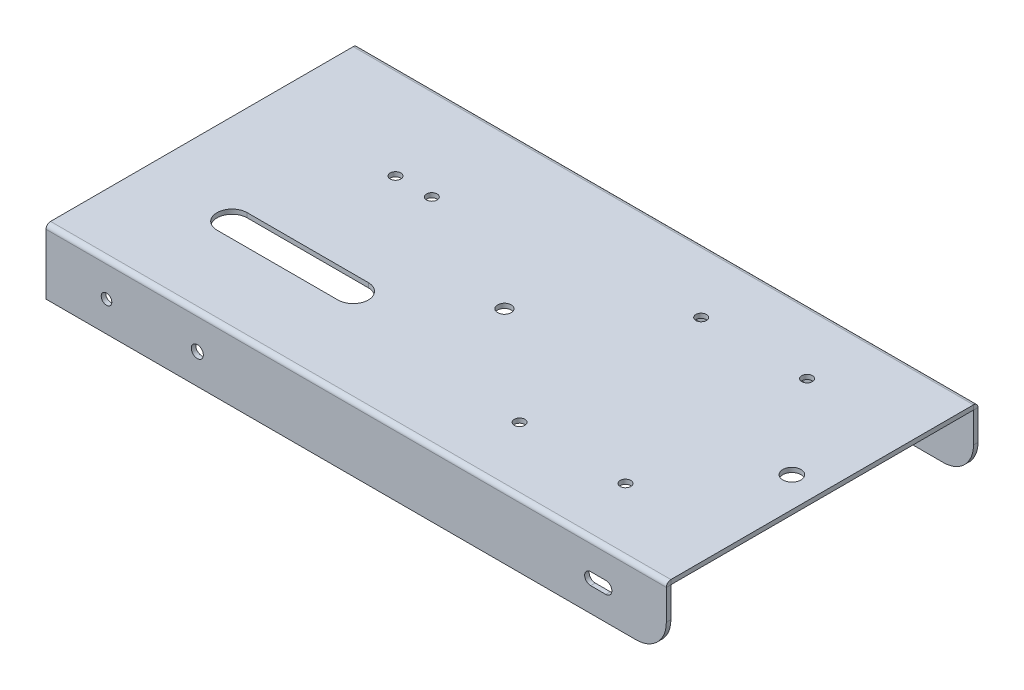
ISO-10303-21;
HEADER;
FILE_DESCRIPTION(('STEP AP214'),'2;1');
FILE_NAME('part.step','',(''),(''),'','','');
FILE_SCHEMA(('AUTOMOTIVE_DESIGN { 1 0 10303 214 1 1 1 1 }'));
ENDSEC;
DATA;
#1=APPLICATION_CONTEXT('core data for automotive mechanical design processes');
#2=APPLICATION_PROTOCOL_DEFINITION('international standard','automotive_design',2000,#1);
#3=PRODUCT_CONTEXT('',#1,'mechanical');
#4=PRODUCT('Part','Part','',(#3));
#5=PRODUCT_RELATED_PRODUCT_CATEGORY('part','',(#4));
#6=PRODUCT_DEFINITION_FORMATION('','',#4);
#7=PRODUCT_DEFINITION_CONTEXT('part definition',#1,'design');
#8=PRODUCT_DEFINITION('design','',#6,#7);
#9=PRODUCT_DEFINITION_SHAPE('','',#8);
#10=(LENGTH_UNIT() NAMED_UNIT(*) SI_UNIT(.MILLI.,.METRE.));
#11=(NAMED_UNIT(*) PLANE_ANGLE_UNIT() SI_UNIT($,.RADIAN.));
#12=(NAMED_UNIT(*) SI_UNIT($,.STERADIAN.) SOLID_ANGLE_UNIT());
#13=UNCERTAINTY_MEASURE_WITH_UNIT(LENGTH_MEASURE(1.E-05),#10,'distance_accuracy_value','');
#14=(GEOMETRIC_REPRESENTATION_CONTEXT(3) GLOBAL_UNCERTAINTY_ASSIGNED_CONTEXT((#13)) GLOBAL_UNIT_ASSIGNED_CONTEXT((#10,
#11,#12)) REPRESENTATION_CONTEXT('',''));
#15=CARTESIAN_POINT('',(0.,0.,0.));
#16=DIRECTION('',(0.,0.,1.));
#17=DIRECTION('',(1.,0.,0.));
#18=AXIS2_PLACEMENT_3D('',#15,#16,#17);
#19=CARTESIAN_POINT('',(205.,1.5,-60.));
#20=DIRECTION('',(-1.,0.,0.));
#21=DIRECTION('',(0.,0.,1.));
#22=AXIS2_PLACEMENT_3D('',#19,#20,#21);
#23=PLANE('',#22);
#24=DIRECTION('',(0.,0.,-1.));
#25=VECTOR('',#24,1.);
#26=CARTESIAN_POINT('',(205.,1.5,-60.));
#27=LINE('',#26,#25);
#28=CARTESIAN_POINT('',(205.,1.5,49.9999882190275));
#29=VERTEX_POINT('',#28);
#30=CARTESIAN_POINT('',(205.,1.5,-49.9999882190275));
#31=VERTEX_POINT('',#30);
#32=EDGE_CURVE('E43',#29,#31,#27,.T.);
#33=ORIENTED_EDGE('',*,*,#32,.F.);
#34=DIRECTION('',(0.,-1.,0.));
#35=VECTOR('',#34,1.);
#36=CARTESIAN_POINT('',(205.,1.50000000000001,49.9999882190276));
#37=LINE('',#36,#35);
#38=CARTESIAN_POINT('',(205.,0.,49.9999882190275));
#39=VERTEX_POINT('',#38);
#40=EDGE_CURVE('E12',#29,#39,#37,.T.);
#41=ORIENTED_EDGE('',*,*,#40,.T.);
#42=DIRECTION('',(0.,0.,-1.));
#43=VECTOR('',#42,1.);
#44=CARTESIAN_POINT('',(205.,0.,-60.));
#45=LINE('',#44,#43);
#46=CARTESIAN_POINT('',(205.,0.,-49.9999882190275));
#47=VERTEX_POINT('',#46);
#48=EDGE_CURVE('E436',#39,#47,#45,.T.);
#49=ORIENTED_EDGE('',*,*,#48,.T.);
#50=DIRECTION('',(0.,-1.,0.));
#51=VECTOR('',#50,1.);
#52=CARTESIAN_POINT('',(205.,1.5,-49.9999882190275));
#53=LINE('',#52,#51);
#54=EDGE_CURVE('E421',#31,#47,#53,.T.);
#55=ORIENTED_EDGE('',*,*,#54,.F.);
#56=EDGE_LOOP('',(#33,#41,#49,#55));
#57=FACE_BOUND('',#56,.T.);
#58=ADVANCED_FACE('F40',(#57),#23,.F.);
#59=CARTESIAN_POINT('',(0.,1.5,70.));
#60=DIRECTION('',(1.,0.,0.));
#61=DIRECTION('',(0.,0.,-1.));
#62=AXIS2_PLACEMENT_3D('',#59,#60,#61);
#63=PLANE('',#62);
#64=DIRECTION('',(0.,0.,1.));
#65=VECTOR('',#64,1.);
#66=CARTESIAN_POINT('',(0.,0.,70.));
#67=LINE('',#66,#65);
#68=CARTESIAN_POINT('',(0.,0.,-49.9999882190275));
#69=VERTEX_POINT('',#68);
#70=CARTESIAN_POINT('',(0.,0.,49.9999882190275));
#71=VERTEX_POINT('',#70);
#72=EDGE_CURVE('E56',#69,#71,#67,.T.);
#73=ORIENTED_EDGE('',*,*,#72,.T.);
#74=DIRECTION('',(0.,1.,0.));
#75=VECTOR('',#74,1.);
#76=CARTESIAN_POINT('',(0.,1.5,49.9999882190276));
#77=LINE('',#76,#75);
#78=CARTESIAN_POINT('',(0.,1.5,49.9999882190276));
#79=VERTEX_POINT('',#78);
#80=EDGE_CURVE('E432',#71,#79,#77,.T.);
#81=ORIENTED_EDGE('',*,*,#80,.T.);
#82=DIRECTION('',(0.,0.,1.));
#83=VECTOR('',#82,1.);
#84=CARTESIAN_POINT('',(0.,1.5,70.));
#85=LINE('',#84,#83);
#86=CARTESIAN_POINT('',(0.,1.5,-49.9999882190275));
#87=VERTEX_POINT('',#86);
#88=EDGE_CURVE('E439',#87,#79,#85,.T.);
#89=ORIENTED_EDGE('',*,*,#88,.F.);
#90=DIRECTION('',(0.,1.,0.));
#91=VECTOR('',#90,1.);
#92=CARTESIAN_POINT('',(0.,1.49999999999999,-49.9999882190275));
#93=LINE('',#92,#91);
#94=EDGE_CURVE('E426',#69,#87,#93,.T.);
#95=ORIENTED_EDGE('',*,*,#94,.F.);
#96=EDGE_LOOP('',(#73,#81,#89,#95));
#97=FACE_BOUND('',#96,.T.);
#98=ADVANCED_FACE('F445',(#97),#63,.F.);
#99=CARTESIAN_POINT('',(195.,0.,-60.));
#100=DIRECTION('',(0.,1.,0.));
#101=DIRECTION('',(0.,0.,1.));
#102=AXIS2_PLACEMENT_3D('',#99,#100,#101);
#103=PLANE('',#102);
#104=CARTESIAN_POINT('',(56.,0.,-20.));
#105=DIRECTION('',(0.,1.,0.));
#106=DIRECTION('',(0.,0.,1.));
#107=AXIS2_PLACEMENT_3D('',#104,#105,#106);
#108=CIRCLE('',#107,1.75);
#109=CARTESIAN_POINT('',(56.,0.,-18.25));
#110=VERTEX_POINT('',#109);
#111=EDGE_CURVE('E340',#110,#110,#108,.T.);
#112=ORIENTED_EDGE('',*,*,#111,.T.);
#113=EDGE_LOOP('',(#112));
#114=FACE_BOUND('',#113,.T.);
#115=CARTESIAN_POINT('',(100.,0.,0.));
#116=DIRECTION('',(0.,1.,0.));
#117=DIRECTION('',(0.,0.,1.));
#118=AXIS2_PLACEMENT_3D('',#115,#116,#117);
#119=CIRCLE('',#118,2.25);
#120=CARTESIAN_POINT('',(100.,0.,2.25));
#121=VERTEX_POINT('',#120);
#122=EDGE_CURVE('E350',#121,#121,#119,.T.);
#123=ORIENTED_EDGE('',*,*,#122,.T.);
#124=EDGE_LOOP('',(#123));
#125=FACE_BOUND('',#124,.T.);
#126=CARTESIAN_POINT('',(70.,0.,20.));
#127=DIRECTION('',(0.,1.,0.));
#128=DIRECTION('',(0.,0.,1.));
#129=AXIS2_PLACEMENT_3D('',#126,#127,#128);
#130=CIRCLE('',#129,5.00000000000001);
#131=CARTESIAN_POINT('',(70.,0.,25.));
#132=VERTEX_POINT('',#131);
#133=CARTESIAN_POINT('',(70.,0.,15.));
#134=VERTEX_POINT('',#133);
#135=EDGE_CURVE('E362',#132,#134,#130,.T.);
#136=ORIENTED_EDGE('',*,*,#135,.T.);
#137=DIRECTION('',(-1.,0.,0.));
#138=VECTOR('',#137,1.);
#139=CARTESIAN_POINT('',(70.,0.,15.));
#140=LINE('',#139,#138);
#141=CARTESIAN_POINT('',(30.,0.,15.));
#142=VERTEX_POINT('',#141);
#143=EDGE_CURVE('E378',#134,#142,#140,.T.);
#144=ORIENTED_EDGE('',*,*,#143,.T.);
#145=CARTESIAN_POINT('',(30.,0.,20.));
#146=DIRECTION('',(0.,1.,0.));
#147=DIRECTION('',(0.,0.,1.));
#148=AXIS2_PLACEMENT_3D('',#145,#146,#147);
#149=CIRCLE('',#148,5.00000000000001);
#150=CARTESIAN_POINT('',(30.,0.,25.));
#151=VERTEX_POINT('',#150);
#152=EDGE_CURVE('E381',#142,#151,#149,.T.);
#153=ORIENTED_EDGE('',*,*,#152,.T.);
#154=DIRECTION('',(1.,0.,0.));
#155=VECTOR('',#154,1.);
#156=CARTESIAN_POINT('',(30.,0.,25.));
#157=LINE('',#156,#155);
#158=EDGE_CURVE('E368',#151,#132,#157,.T.);
#159=ORIENTED_EDGE('',*,*,#158,.T.);
#160=EDGE_LOOP('',(#136,#144,#153,#159));
#161=FACE_BOUND('',#160,.T.);
#162=CARTESIAN_POINT('',(135.,0.,30.));
#163=DIRECTION('',(0.,1.,0.));
#164=DIRECTION('',(0.,0.,-1.));
#165=AXIS2_PLACEMENT_3D('',#162,#163,#164);
#166=CIRCLE('',#165,1.75000000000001);
#167=CARTESIAN_POINT('',(135.,0.,28.25));
#168=VERTEX_POINT('',#167);
#169=EDGE_CURVE('E399',#168,#168,#166,.T.);
#170=ORIENTED_EDGE('',*,*,#169,.T.);
#171=EDGE_LOOP('',(#170));
#172=FACE_BOUND('',#171,.T.);
#173=CARTESIAN_POINT('',(170.,0.,-30.));
#174=DIRECTION('',(0.,1.,0.));
#175=DIRECTION('',(0.,0.,1.));
#176=AXIS2_PLACEMENT_3D('',#173,#174,#175);
#177=CIRCLE('',#176,1.75000000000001);
#178=CARTESIAN_POINT('',(170.,0.,-28.25));
#179=VERTEX_POINT('',#178);
#180=EDGE_CURVE('E411',#179,#179,#177,.T.);
#181=ORIENTED_EDGE('',*,*,#180,.T.);
#182=EDGE_LOOP('',(#181));
#183=FACE_BOUND('',#182,.T.);
#184=CARTESIAN_POINT('',(135.,0.,-30.));
#185=DIRECTION('',(0.,1.,0.));
#186=DIRECTION('',(0.,0.,1.));
#187=AXIS2_PLACEMENT_3D('',#184,#185,#186);
#188=CIRCLE('',#187,1.75000000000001);
#189=CARTESIAN_POINT('',(135.,0.,-28.25));
#190=VERTEX_POINT('',#189);
#191=EDGE_CURVE('E405',#190,#190,#188,.T.);
#192=ORIENTED_EDGE('',*,*,#191,.T.);
#193=EDGE_LOOP('',(#192));
#194=FACE_BOUND('',#193,.T.);
#195=CARTESIAN_POINT('',(170.,0.,30.));
#196=DIRECTION('',(0.,1.,0.));
#197=DIRECTION('',(0.,0.,-1.));
#198=AXIS2_PLACEMENT_3D('',#195,#196,#197);
#199=CIRCLE('',#198,1.75000000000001);
#200=CARTESIAN_POINT('',(170.,0.,28.25));
#201=VERTEX_POINT('',#200);
#202=EDGE_CURVE('E395',#201,#201,#199,.T.);
#203=ORIENTED_EDGE('',*,*,#202,.T.);
#204=EDGE_LOOP('',(#203));
#205=FACE_BOUND('',#204,.T.);
#206=CARTESIAN_POINT('',(195.,0.,0.));
#207=DIRECTION('',(0.,1.,0.));
#208=DIRECTION('',(0.,0.,1.));
#209=AXIS2_PLACEMENT_3D('',#206,#207,#208);
#210=CIRCLE('',#209,3.00000000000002);
#211=CARTESIAN_POINT('',(195.,0.,3.00000000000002));
#212=VERTEX_POINT('',#211);
#213=EDGE_CURVE('E356',#212,#212,#210,.T.);
#214=ORIENTED_EDGE('',*,*,#213,.T.);
#215=EDGE_LOOP('',(#214));
#216=FACE_BOUND('',#215,.T.);
#217=CARTESIAN_POINT('',(44.,0.,-20.));
#218=DIRECTION('',(0.,1.,0.));
#219=DIRECTION('',(0.,0.,1.));
#220=AXIS2_PLACEMENT_3D('',#217,#218,#219);
#221=CIRCLE('',#220,1.75);
#222=CARTESIAN_POINT('',(44.,0.,-18.25));
#223=VERTEX_POINT('',#222);
#224=EDGE_CURVE('E344',#223,#223,#221,.T.);
#225=ORIENTED_EDGE('',*,*,#224,.T.);
#226=EDGE_LOOP('',(#225));
#227=FACE_BOUND('',#226,.T.);
#228=ORIENTED_EDGE('',*,*,#48,.F.);
#229=DIRECTION('',(-1.,0.,0.));
#230=VECTOR('',#229,1.);
#231=CARTESIAN_POINT('',(195.,0.,49.9999882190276));
#232=LINE('',#231,#230);
#233=EDGE_CURVE('E48',#39,#71,#232,.T.);
#234=ORIENTED_EDGE('',*,*,#233,.T.);
#235=ORIENTED_EDGE('',*,*,#72,.F.);
#236=DIRECTION('',(-1.,0.,0.));
#237=VECTOR('',#236,1.);
#238=CARTESIAN_POINT('',(195.,0.,-49.9999882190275));
#239=LINE('',#238,#237);
#240=EDGE_CURVE('E423',#47,#69,#239,.T.);
#241=ORIENTED_EDGE('',*,*,#240,.F.);
#242=EDGE_LOOP('',(#228,#234,#235,#241));
#243=FACE_BOUND('',#242,.T.);
#244=ADVANCED_FACE('F479',(#114,#125,#161,#172,#183,#194,#205,#216,#227,#243),#103,.F.);
#245=CARTESIAN_POINT('',(195.,1.5,-60.));
#246=DIRECTION('',(0.,1.,0.));
#247=DIRECTION('',(0.,0.,1.));
#248=AXIS2_PLACEMENT_3D('',#245,#246,#247);
#249=PLANE('',#248);
#250=DIRECTION('',(-1.,0.,0.));
#251=VECTOR('',#250,1.);
#252=CARTESIAN_POINT('',(195.,1.5,49.9999882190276));
#253=LINE('',#252,#251);
#254=EDGE_CURVE('E429',#29,#79,#253,.T.);
#255=ORIENTED_EDGE('',*,*,#254,.F.);
#256=ORIENTED_EDGE('',*,*,#32,.T.);
#257=DIRECTION('',(-1.,0.,0.));
#258=VECTOR('',#257,1.);
#259=CARTESIAN_POINT('',(195.,1.5,-49.9999882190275));
#260=LINE('',#259,#258);
#261=EDGE_CURVE('E419',#31,#87,#260,.T.);
#262=ORIENTED_EDGE('',*,*,#261,.T.);
#263=ORIENTED_EDGE('',*,*,#88,.T.);
#264=EDGE_LOOP('',(#255,#256,#262,#263));
#265=FACE_BOUND('',#264,.T.);
#266=CARTESIAN_POINT('',(44.,1.5,-20.));
#267=DIRECTION('',(0.,1.,0.));
#268=DIRECTION('',(0.,0.,1.));
#269=AXIS2_PLACEMENT_3D('',#266,#267,#268);
#270=CIRCLE('',#269,1.75);
#271=CARTESIAN_POINT('',(44.,1.5,-18.25));
#272=VERTEX_POINT('',#271);
#273=EDGE_CURVE('E347',#272,#272,#270,.T.);
#274=ORIENTED_EDGE('',*,*,#273,.F.);
#275=EDGE_LOOP('',(#274));
#276=FACE_BOUND('',#275,.T.);
#277=CARTESIAN_POINT('',(195.,1.5,0.));
#278=DIRECTION('',(0.,1.,0.));
#279=DIRECTION('',(0.,0.,1.));
#280=AXIS2_PLACEMENT_3D('',#277,#278,#279);
#281=CIRCLE('',#280,3.00000000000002);
#282=CARTESIAN_POINT('',(195.,1.5,3.00000000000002));
#283=VERTEX_POINT('',#282);
#284=EDGE_CURVE('E359',#283,#283,#281,.T.);
#285=ORIENTED_EDGE('',*,*,#284,.F.);
#286=EDGE_LOOP('',(#285));
#287=FACE_BOUND('',#286,.T.);
#288=CARTESIAN_POINT('',(170.,1.5,30.));
#289=DIRECTION('',(0.,1.,0.));
#290=DIRECTION('',(0.,0.,-1.));
#291=AXIS2_PLACEMENT_3D('',#288,#289,#290);
#292=CIRCLE('',#291,1.75000000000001);
#293=CARTESIAN_POINT('',(170.,1.5,28.25));
#294=VERTEX_POINT('',#293);
#295=EDGE_CURVE('E396',#294,#294,#292,.T.);
#296=ORIENTED_EDGE('',*,*,#295,.F.);
#297=EDGE_LOOP('',(#296));
#298=FACE_BOUND('',#297,.T.);
#299=CARTESIAN_POINT('',(135.,1.5,-30.));
#300=DIRECTION('',(0.,1.,0.));
#301=DIRECTION('',(0.,0.,1.));
#302=AXIS2_PLACEMENT_3D('',#299,#300,#301);
#303=CIRCLE('',#302,1.75000000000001);
#304=CARTESIAN_POINT('',(135.,1.5,-28.25));
#305=VERTEX_POINT('',#304);
#306=EDGE_CURVE('E408',#305,#305,#303,.T.);
#307=ORIENTED_EDGE('',*,*,#306,.F.);
#308=EDGE_LOOP('',(#307));
#309=FACE_BOUND('',#308,.T.);
#310=CARTESIAN_POINT('',(170.,1.5,-30.));
#311=DIRECTION('',(0.,1.,0.));
#312=DIRECTION('',(0.,0.,1.));
#313=AXIS2_PLACEMENT_3D('',#310,#311,#312);
#314=CIRCLE('',#313,1.75000000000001);
#315=CARTESIAN_POINT('',(170.,1.5,-28.25));
#316=VERTEX_POINT('',#315);
#317=EDGE_CURVE('E414',#316,#316,#314,.T.);
#318=ORIENTED_EDGE('',*,*,#317,.F.);
#319=EDGE_LOOP('',(#318));
#320=FACE_BOUND('',#319,.T.);
#321=CARTESIAN_POINT('',(135.,1.5,30.));
#322=DIRECTION('',(0.,1.,0.));
#323=DIRECTION('',(0.,0.,-1.));
#324=AXIS2_PLACEMENT_3D('',#321,#322,#323);
#325=CIRCLE('',#324,1.75000000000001);
#326=CARTESIAN_POINT('',(135.,1.5,28.25));
#327=VERTEX_POINT('',#326);
#328=EDGE_CURVE('E402',#327,#327,#325,.T.);
#329=ORIENTED_EDGE('',*,*,#328,.F.);
#330=EDGE_LOOP('',(#329));
#331=FACE_BOUND('',#330,.T.);
#332=DIRECTION('',(-1.,0.,0.));
#333=VECTOR('',#332,1.);
#334=CARTESIAN_POINT('',(70.,1.5,15.));
#335=LINE('',#334,#333);
#336=CARTESIAN_POINT('',(70.,1.5,15.));
#337=VERTEX_POINT('',#336);
#338=CARTESIAN_POINT('',(30.,1.5,15.));
#339=VERTEX_POINT('',#338);
#340=EDGE_CURVE('E367',#337,#339,#335,.T.);
#341=ORIENTED_EDGE('',*,*,#340,.F.);
#342=CARTESIAN_POINT('',(70.,1.5,20.));
#343=DIRECTION('',(0.,1.,0.));
#344=DIRECTION('',(0.,0.,1.));
#345=AXIS2_PLACEMENT_3D('',#342,#343,#344);
#346=CIRCLE('',#345,5.00000000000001);
#347=CARTESIAN_POINT('',(70.,1.5,25.));
#348=VERTEX_POINT('',#347);
#349=EDGE_CURVE('E365',#348,#337,#346,.T.);
#350=ORIENTED_EDGE('',*,*,#349,.F.);
#351=DIRECTION('',(1.,0.,0.));
#352=VECTOR('',#351,1.);
#353=CARTESIAN_POINT('',(30.,1.5,25.));
#354=LINE('',#353,#352);
#355=CARTESIAN_POINT('',(30.,1.5,25.));
#356=VERTEX_POINT('',#355);
#357=EDGE_CURVE('E373',#356,#348,#354,.T.);
#358=ORIENTED_EDGE('',*,*,#357,.F.);
#359=CARTESIAN_POINT('',(30.,1.5,20.));
#360=DIRECTION('',(0.,1.,0.));
#361=DIRECTION('',(0.,0.,1.));
#362=AXIS2_PLACEMENT_3D('',#359,#360,#361);
#363=CIRCLE('',#362,5.00000000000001);
#364=EDGE_CURVE('E370',#339,#356,#363,.T.);
#365=ORIENTED_EDGE('',*,*,#364,.F.);
#366=EDGE_LOOP('',(#341,#350,#358,#365));
#367=FACE_BOUND('',#366,.T.);
#368=CARTESIAN_POINT('',(100.,1.5,0.));
#369=DIRECTION('',(0.,1.,0.));
#370=DIRECTION('',(0.,0.,1.));
#371=AXIS2_PLACEMENT_3D('',#368,#369,#370);
#372=CIRCLE('',#371,2.25);
#373=CARTESIAN_POINT('',(100.,1.5,2.25));
#374=VERTEX_POINT('',#373);
#375=EDGE_CURVE('E353',#374,#374,#372,.T.);
#376=ORIENTED_EDGE('',*,*,#375,.F.);
#377=EDGE_LOOP('',(#376));
#378=FACE_BOUND('',#377,.T.);
#379=CARTESIAN_POINT('',(56.,1.5,-20.));
#380=DIRECTION('',(0.,1.,0.));
#381=DIRECTION('',(0.,0.,1.));
#382=AXIS2_PLACEMENT_3D('',#379,#380,#381);
#383=CIRCLE('',#382,1.75);
#384=CARTESIAN_POINT('',(56.,1.5,-18.25));
#385=VERTEX_POINT('',#384);
#386=EDGE_CURVE('E341',#385,#385,#383,.T.);
#387=ORIENTED_EDGE('',*,*,#386,.F.);
#388=EDGE_LOOP('',(#387));
#389=FACE_BOUND('',#388,.T.);
#390=ADVANCED_FACE('F441',(#265,#276,#287,#298,#309,#320,#331,#367,#378,#389),#249,.T.);
#391=CARTESIAN_POINT('',(170.,1.5,-30.));
#392=DIRECTION('',(0.,-1.,0.));
#393=DIRECTION('',(0.,0.,-1.));
#394=AXIS2_PLACEMENT_3D('',#391,#392,#393);
#395=CYLINDRICAL_SURFACE('',#394,1.75000000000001);
#396=ORIENTED_EDGE('',*,*,#317,.T.);
#397=EDGE_LOOP('',(#396));
#398=FACE_BOUND('',#397,.T.);
#399=ORIENTED_EDGE('',*,*,#180,.F.);
#400=EDGE_LOOP('',(#399));
#401=FACE_BOUND('',#400,.T.);
#402=ADVANCED_FACE('F566',(#398,#401),#395,.F.);
#403=CARTESIAN_POINT('',(135.,1.5,-30.));
#404=DIRECTION('',(0.,-1.,0.));
#405=DIRECTION('',(0.,0.,-1.));
#406=AXIS2_PLACEMENT_3D('',#403,#404,#405);
#407=CYLINDRICAL_SURFACE('',#406,1.75000000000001);
#408=ORIENTED_EDGE('',*,*,#306,.T.);
#409=EDGE_LOOP('',(#408));
#410=FACE_BOUND('',#409,.T.);
#411=ORIENTED_EDGE('',*,*,#191,.F.);
#412=EDGE_LOOP('',(#411));
#413=FACE_BOUND('',#412,.T.);
#414=ADVANCED_FACE('F569',(#410,#413),#407,.F.);
#415=CARTESIAN_POINT('',(135.,1.5,30.));
#416=DIRECTION('',(0.,-1.,0.));
#417=DIRECTION('',(0.,0.,-1.));
#418=AXIS2_PLACEMENT_3D('',#415,#416,#417);
#419=CYLINDRICAL_SURFACE('',#418,1.75000000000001);
#420=ORIENTED_EDGE('',*,*,#328,.T.);
#421=EDGE_LOOP('',(#420));
#422=FACE_BOUND('',#421,.T.);
#423=ORIENTED_EDGE('',*,*,#169,.F.);
#424=EDGE_LOOP('',(#423));
#425=FACE_BOUND('',#424,.T.);
#426=ADVANCED_FACE('F573',(#422,#425),#419,.F.);
#427=CARTESIAN_POINT('',(170.,1.5,30.));
#428=DIRECTION('',(0.,-1.,0.));
#429=DIRECTION('',(0.,0.,-1.));
#430=AXIS2_PLACEMENT_3D('',#427,#428,#429);
#431=CYLINDRICAL_SURFACE('',#430,1.75000000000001);
#432=ORIENTED_EDGE('',*,*,#295,.T.);
#433=EDGE_LOOP('',(#432));
#434=FACE_BOUND('',#433,.T.);
#435=ORIENTED_EDGE('',*,*,#202,.F.);
#436=EDGE_LOOP('',(#435));
#437=FACE_BOUND('',#436,.T.);
#438=ADVANCED_FACE('F577',(#434,#437),#431,.F.);
#439=CARTESIAN_POINT('',(70.,1.5,20.));
#440=DIRECTION('',(0.,-1.,0.));
#441=DIRECTION('',(0.,0.,-1.));
#442=AXIS2_PLACEMENT_3D('',#439,#440,#441);
#443=CYLINDRICAL_SURFACE('',#442,5.00000000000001);
#444=ORIENTED_EDGE('',*,*,#135,.F.);
#445=DIRECTION('',(0.,-1.,0.));
#446=VECTOR('',#445,1.);
#447=CARTESIAN_POINT('',(70.,1.5,25.));
#448=LINE('',#447,#446);
#449=EDGE_CURVE('E375',#348,#132,#448,.T.);
#450=ORIENTED_EDGE('',*,*,#449,.F.);
#451=ORIENTED_EDGE('',*,*,#349,.T.);
#452=DIRECTION('',(0.,-1.,0.));
#453=VECTOR('',#452,1.);
#454=CARTESIAN_POINT('',(70.,1.5,15.));
#455=LINE('',#454,#453);
#456=EDGE_CURVE('E392',#337,#134,#455,.T.);
#457=ORIENTED_EDGE('',*,*,#456,.T.);
#458=EDGE_LOOP('',(#444,#450,#451,#457));
#459=FACE_BOUND('',#458,.T.);
#460=ADVANCED_FACE('F581',(#459),#443,.F.);
#461=CARTESIAN_POINT('',(70.,1.5,15.));
#462=DIRECTION('',(0.,0.,1.));
#463=DIRECTION('',(1.,0.,0.));
#464=AXIS2_PLACEMENT_3D('',#461,#462,#463);
#465=PLANE('',#464);
#466=ORIENTED_EDGE('',*,*,#143,.F.);
#467=ORIENTED_EDGE('',*,*,#456,.F.);
#468=ORIENTED_EDGE('',*,*,#340,.T.);
#469=DIRECTION('',(0.,-1.,0.));
#470=VECTOR('',#469,1.);
#471=CARTESIAN_POINT('',(30.,1.5,15.));
#472=LINE('',#471,#470);
#473=EDGE_CURVE('E390',#339,#142,#472,.T.);
#474=ORIENTED_EDGE('',*,*,#473,.T.);
#475=EDGE_LOOP('',(#466,#467,#468,#474));
#476=FACE_BOUND('',#475,.T.);
#477=ADVANCED_FACE('F585',(#476),#465,.T.);
#478=CARTESIAN_POINT('',(30.,1.5,20.));
#479=DIRECTION('',(0.,-1.,0.));
#480=DIRECTION('',(0.,0.,-1.));
#481=AXIS2_PLACEMENT_3D('',#478,#479,#480);
#482=CYLINDRICAL_SURFACE('',#481,5.00000000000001);
#483=ORIENTED_EDGE('',*,*,#152,.F.);
#484=ORIENTED_EDGE('',*,*,#473,.F.);
#485=ORIENTED_EDGE('',*,*,#364,.T.);
#486=DIRECTION('',(0.,-1.,0.));
#487=VECTOR('',#486,1.);
#488=CARTESIAN_POINT('',(30.,1.5,25.));
#489=LINE('',#488,#487);
#490=EDGE_CURVE('E388',#356,#151,#489,.T.);
#491=ORIENTED_EDGE('',*,*,#490,.T.);
#492=EDGE_LOOP('',(#483,#484,#485,#491));
#493=FACE_BOUND('',#492,.T.);
#494=ADVANCED_FACE('F589',(#493),#482,.F.);
#495=CARTESIAN_POINT('',(30.,1.5,25.));
#496=DIRECTION('',(0.,0.,-1.));
#497=DIRECTION('',(-1.,0.,0.));
#498=AXIS2_PLACEMENT_3D('',#495,#496,#497);
#499=PLANE('',#498);
#500=ORIENTED_EDGE('',*,*,#158,.F.);
#501=ORIENTED_EDGE('',*,*,#490,.F.);
#502=ORIENTED_EDGE('',*,*,#357,.T.);
#503=ORIENTED_EDGE('',*,*,#449,.T.);
#504=EDGE_LOOP('',(#500,#501,#502,#503));
#505=FACE_BOUND('',#504,.T.);
#506=ADVANCED_FACE('F593',(#505),#499,.T.);
#507=CARTESIAN_POINT('',(195.,1.5,0.));
#508=DIRECTION('',(0.,-1.,0.));
#509=DIRECTION('',(0.,0.,-1.));
#510=AXIS2_PLACEMENT_3D('',#507,#508,#509);
#511=CYLINDRICAL_SURFACE('',#510,3.00000000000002);
#512=ORIENTED_EDGE('',*,*,#284,.T.);
#513=EDGE_LOOP('',(#512));
#514=FACE_BOUND('',#513,.T.);
#515=ORIENTED_EDGE('',*,*,#213,.F.);
#516=EDGE_LOOP('',(#515));
#517=FACE_BOUND('',#516,.T.);
#518=ADVANCED_FACE('F597',(#514,#517),#511,.F.);
#519=CARTESIAN_POINT('',(100.,1.5,0.));
#520=DIRECTION('',(0.,-1.,0.));
#521=DIRECTION('',(0.,0.,-1.));
#522=AXIS2_PLACEMENT_3D('',#519,#520,#521);
#523=CYLINDRICAL_SURFACE('',#522,2.25);
#524=ORIENTED_EDGE('',*,*,#375,.T.);
#525=EDGE_LOOP('',(#524));
#526=FACE_BOUND('',#525,.T.);
#527=ORIENTED_EDGE('',*,*,#122,.F.);
#528=EDGE_LOOP('',(#527));
#529=FACE_BOUND('',#528,.T.);
#530=ADVANCED_FACE('F601',(#526,#529),#523,.F.);
#531=CARTESIAN_POINT('',(44.,1.5,-20.));
#532=DIRECTION('',(0.,-1.,0.));
#533=DIRECTION('',(0.,0.,-1.));
#534=AXIS2_PLACEMENT_3D('',#531,#532,#533);
#535=CYLINDRICAL_SURFACE('',#534,1.75);
#536=ORIENTED_EDGE('',*,*,#273,.T.);
#537=EDGE_LOOP('',(#536));
#538=FACE_BOUND('',#537,.T.);
#539=ORIENTED_EDGE('',*,*,#224,.F.);
#540=EDGE_LOOP('',(#539));
#541=FACE_BOUND('',#540,.T.);
#542=ADVANCED_FACE('F605',(#538,#541),#535,.F.);
#543=CARTESIAN_POINT('',(56.,1.5,-20.));
#544=DIRECTION('',(0.,-1.,0.));
#545=DIRECTION('',(0.,0.,-1.));
#546=AXIS2_PLACEMENT_3D('',#543,#544,#545);
#547=CYLINDRICAL_SURFACE('',#546,1.75);
#548=ORIENTED_EDGE('',*,*,#386,.T.);
#549=EDGE_LOOP('',(#548));
#550=FACE_BOUND('',#549,.T.);
#551=ORIENTED_EDGE('',*,*,#111,.F.);
#552=EDGE_LOOP('',(#551));
#553=FACE_BOUND('',#552,.T.);
#554=ADVANCED_FACE('F609',(#550,#553),#547,.F.);
#555=CARTESIAN_POINT('',(205.,0.,-49.9999882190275));
#556=DIRECTION('',(1.,0.,0.));
#557=DIRECTION('',(0.,0.,-1.));
#558=AXIS2_PLACEMENT_3D('',#555,#556,#557);
#559=CYLINDRICAL_SURFACE('',#558,1.5);
#560=CARTESIAN_POINT('',(205.,0.,-49.9999882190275));
#561=DIRECTION('',(1.,0.,0.));
#562=DIRECTION('',(0.,0.,-1.));
#563=AXIS2_PLACEMENT_3D('',#560,#561,#562);
#564=CIRCLE('',#563,1.5);
#565=CARTESIAN_POINT('',(205.,0.,-51.4999882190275));
#566=VERTEX_POINT('',#565);
#567=EDGE_CURVE('E337',#566,#31,#564,.T.);
#568=ORIENTED_EDGE('',*,*,#567,.F.);
#569=DIRECTION('',(-1.,0.,0.));
#570=VECTOR('',#569,1.);
#571=CARTESIAN_POINT('',(195.,0.,-51.4999882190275));
#572=LINE('',#571,#570);
#573=CARTESIAN_POINT('',(0.,0.,-51.4999882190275));
#574=VERTEX_POINT('',#573);
#575=EDGE_CURVE('E247',#566,#574,#572,.T.);
#576=ORIENTED_EDGE('',*,*,#575,.T.);
#577=CARTESIAN_POINT('',(0.,0.,-49.9999882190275));
#578=DIRECTION('',(1.,0.,0.));
#579=DIRECTION('',(0.,0.,-1.));
#580=AXIS2_PLACEMENT_3D('',#577,#578,#579);
#581=CIRCLE('',#580,1.5);
#582=EDGE_CURVE('E251',#574,#87,#581,.T.);
#583=ORIENTED_EDGE('',*,*,#582,.T.);
#584=ORIENTED_EDGE('',*,*,#261,.F.);
#585=EDGE_LOOP('',(#568,#576,#583,#584));
#586=FACE_BOUND('',#585,.T.);
#587=ADVANCED_FACE('F467',(#586),#559,.T.);
#588=CARTESIAN_POINT('',(205.,0.,-51.4999882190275));
#589=DIRECTION('',(-1.,0.,0.));
#590=DIRECTION('',(0.,0.,1.));
#591=AXIS2_PLACEMENT_3D('',#588,#589,#590);
#592=PLANE('',#591);
#593=ORIENTED_EDGE('',*,*,#54,.T.);
#594=DIRECTION('',(0.,0.,1.));
#595=VECTOR('',#594,1.);
#596=CARTESIAN_POINT('',(205.,0.,-51.4999882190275));
#597=LINE('',#596,#595);
#598=EDGE_CURVE('E281',#566,#47,#597,.T.);
#599=ORIENTED_EDGE('',*,*,#598,.F.);
#600=ORIENTED_EDGE('',*,*,#567,.T.);
#601=EDGE_LOOP('',(#593,#599,#600));
#602=FACE_BOUND('',#601,.T.);
#603=ADVANCED_FACE('F464',(#602),#592,.F.);
#604=CARTESIAN_POINT('',(0.,0.,-51.4999882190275));
#605=DIRECTION('',(1.,0.,0.));
#606=DIRECTION('',(0.,0.,-1.));
#607=AXIS2_PLACEMENT_3D('',#604,#605,#606);
#608=PLANE('',#607);
#609=DIRECTION('',(0.,0.,-1.));
#610=VECTOR('',#609,1.);
#611=CARTESIAN_POINT('',(0.,0.,-51.4999882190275));
#612=LINE('',#611,#610);
#613=EDGE_CURVE('E252',#69,#574,#612,.T.);
#614=ORIENTED_EDGE('',*,*,#613,.F.);
#615=ORIENTED_EDGE('',*,*,#94,.T.);
#616=ORIENTED_EDGE('',*,*,#582,.F.);
#617=EDGE_LOOP('',(#614,#615,#616));
#618=FACE_BOUND('',#617,.T.);
#619=ADVANCED_FACE('F470',(#618),#608,.F.);
#620=CARTESIAN_POINT('',(50.,-9.99998821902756,-51.4999882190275));
#621=DIRECTION('',(0.,0.,1.));
#622=DIRECTION('',(0.,-1.,0.));
#623=AXIS2_PLACEMENT_3D('',#620,#621,#622);
#624=CYLINDRICAL_SURFACE('',#623,2.);
#625=CARTESIAN_POINT('',(50.,-9.99998821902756,-51.4999882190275));
#626=DIRECTION('',(0.,0.,-1.));
#627=DIRECTION('',(0.,1.,0.));
#628=AXIS2_PLACEMENT_3D('',#625,#626,#627);
#629=CIRCLE('',#628,2.);
#630=CARTESIAN_POINT('',(50.,-7.99998821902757,-51.4999882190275));
#631=VERTEX_POINT('',#630);
#632=EDGE_CURVE('E330',#631,#631,#629,.T.);
#633=ORIENTED_EDGE('',*,*,#632,.T.);
#634=EDGE_LOOP('',(#633));
#635=FACE_BOUND('',#634,.T.);
#636=CARTESIAN_POINT('',(50.,-9.99998821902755,-49.9999882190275));
#637=DIRECTION('',(0.,0.,-1.));
#638=DIRECTION('',(0.,1.,0.));
#639=AXIS2_PLACEMENT_3D('',#636,#637,#638);
#640=CIRCLE('',#639,2.);
#641=CARTESIAN_POINT('',(50.,-7.99998821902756,-49.9999882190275));
#642=VERTEX_POINT('',#641);
#643=EDGE_CURVE('E276',#642,#642,#640,.T.);
#644=ORIENTED_EDGE('',*,*,#643,.F.);
#645=EDGE_LOOP('',(#644));
#646=FACE_BOUND('',#645,.T.);
#647=ADVANCED_FACE('F618',(#635,#646),#624,.F.);
#648=CARTESIAN_POINT('',(185.,-9.99998821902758,-51.4999882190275));
#649=DIRECTION('',(0.,0.,1.));
#650=DIRECTION('',(0.,-1.,0.));
#651=AXIS2_PLACEMENT_3D('',#648,#649,#650);
#652=CYLINDRICAL_SURFACE('',#651,2.);
#653=CARTESIAN_POINT('',(185.,-9.99998821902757,-49.9999882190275));
#654=DIRECTION('',(0.,0.,-1.));
#655=DIRECTION('',(0.,1.,0.));
#656=AXIS2_PLACEMENT_3D('',#653,#654,#655);
#657=CIRCLE('',#656,2.);
#658=CARTESIAN_POINT('',(185.,-7.99998821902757,-49.9999882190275));
#659=VERTEX_POINT('',#658);
#660=CARTESIAN_POINT('',(185.,-11.9999882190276,-49.9999882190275));
#661=VERTEX_POINT('',#660);
#662=EDGE_CURVE('E267',#659,#661,#657,.T.);
#663=ORIENTED_EDGE('',*,*,#662,.F.);
#664=DIRECTION('',(0.,0.,1.));
#665=VECTOR('',#664,1.);
#666=CARTESIAN_POINT('',(185.,-7.99998821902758,-51.4999882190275));
#667=LINE('',#666,#665);
#668=CARTESIAN_POINT('',(185.,-7.99998821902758,-51.4999882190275));
#669=VERTEX_POINT('',#668);
#670=EDGE_CURVE('E311',#669,#659,#667,.T.);
#671=ORIENTED_EDGE('',*,*,#670,.F.);
#672=CARTESIAN_POINT('',(185.,-9.99998821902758,-51.4999882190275));
#673=DIRECTION('',(0.,0.,-1.));
#674=DIRECTION('',(0.,1.,0.));
#675=AXIS2_PLACEMENT_3D('',#672,#673,#674);
#676=CIRCLE('',#675,2.);
#677=CARTESIAN_POINT('',(185.,-11.9999882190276,-51.4999882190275));
#678=VERTEX_POINT('',#677);
#679=EDGE_CURVE('E327',#669,#678,#676,.T.);
#680=ORIENTED_EDGE('',*,*,#679,.T.);
#681=DIRECTION('',(0.,0.,1.));
#682=VECTOR('',#681,1.);
#683=CARTESIAN_POINT('',(185.,-11.9999882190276,-51.4999882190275));
#684=LINE('',#683,#682);
#685=EDGE_CURVE('E325',#678,#661,#684,.T.);
#686=ORIENTED_EDGE('',*,*,#685,.T.);
#687=EDGE_LOOP('',(#663,#671,#680,#686));
#688=FACE_BOUND('',#687,.T.);
#689=ADVANCED_FACE('F661',(#688),#652,.F.);
#690=CARTESIAN_POINT('',(180.,-11.9999882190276,-51.4999882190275));
#691=DIRECTION('',(0.,1.,0.));
#692=DIRECTION('',(1.,0.,0.));
#693=AXIS2_PLACEMENT_3D('',#690,#691,#692);
#694=PLANE('',#693);
#695=DIRECTION('',(-1.,0.,0.));
#696=VECTOR('',#695,1.);
#697=CARTESIAN_POINT('',(180.,-11.9999882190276,-49.9999882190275));
#698=LINE('',#697,#696);
#699=CARTESIAN_POINT('',(180.,-11.9999882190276,-49.9999882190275));
#700=VERTEX_POINT('',#699);
#701=EDGE_CURVE('E264',#661,#700,#698,.T.);
#702=ORIENTED_EDGE('',*,*,#701,.F.);
#703=ORIENTED_EDGE('',*,*,#685,.F.);
#704=DIRECTION('',(-1.,0.,0.));
#705=VECTOR('',#704,1.);
#706=CARTESIAN_POINT('',(180.,-11.9999882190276,-51.4999882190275));
#707=LINE('',#706,#705);
#708=CARTESIAN_POINT('',(180.,-11.9999882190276,-51.4999882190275));
#709=VERTEX_POINT('',#708);
#710=EDGE_CURVE('E323',#678,#709,#707,.T.);
#711=ORIENTED_EDGE('',*,*,#710,.T.);
#712=DIRECTION('',(0.,0.,1.));
#713=VECTOR('',#712,1.);
#714=CARTESIAN_POINT('',(180.,-11.9999882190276,-51.4999882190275));
#715=LINE('',#714,#713);
#716=EDGE_CURVE('E320',#709,#700,#715,.T.);
#717=ORIENTED_EDGE('',*,*,#716,.T.);
#718=EDGE_LOOP('',(#702,#703,#711,#717));
#719=FACE_BOUND('',#718,.T.);
#720=ADVANCED_FACE('F657',(#719),#694,.T.);
#721=CARTESIAN_POINT('',(180.,-9.99998821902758,-51.4999882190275));
#722=DIRECTION('',(0.,0.,1.));
#723=DIRECTION('',(0.,-1.,0.));
#724=AXIS2_PLACEMENT_3D('',#721,#722,#723);
#725=CYLINDRICAL_SURFACE('',#724,2.);
#726=CARTESIAN_POINT('',(180.,-9.99998821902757,-49.9999882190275));
#727=DIRECTION('',(0.,0.,-1.));
#728=DIRECTION('',(0.,1.,0.));
#729=AXIS2_PLACEMENT_3D('',#726,#727,#728);
#730=CIRCLE('',#729,2.);
#731=CARTESIAN_POINT('',(180.,-7.99998821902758,-49.9999882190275));
#732=VERTEX_POINT('',#731);
#733=EDGE_CURVE('E273',#700,#732,#730,.T.);
#734=ORIENTED_EDGE('',*,*,#733,.F.);
#735=ORIENTED_EDGE('',*,*,#716,.F.);
#736=CARTESIAN_POINT('',(180.,-9.99998821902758,-51.4999882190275));
#737=DIRECTION('',(0.,0.,-1.));
#738=DIRECTION('',(0.,1.,0.));
#739=AXIS2_PLACEMENT_3D('',#736,#737,#738);
#740=CIRCLE('',#739,2.);
#741=CARTESIAN_POINT('',(180.,-7.99998821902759,-51.4999882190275));
#742=VERTEX_POINT('',#741);
#743=EDGE_CURVE('E318',#709,#742,#740,.T.);
#744=ORIENTED_EDGE('',*,*,#743,.T.);
#745=DIRECTION('',(0.,0.,1.));
#746=VECTOR('',#745,1.);
#747=CARTESIAN_POINT('',(180.,-7.99998821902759,-51.4999882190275));
#748=LINE('',#747,#746);
#749=EDGE_CURVE('E315',#742,#732,#748,.T.);
#750=ORIENTED_EDGE('',*,*,#749,.T.);
#751=EDGE_LOOP('',(#734,#735,#744,#750));
#752=FACE_BOUND('',#751,.T.);
#753=ADVANCED_FACE('F653',(#752),#725,.F.);
#754=CARTESIAN_POINT('',(185.,-7.99998821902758,-51.4999882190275));
#755=DIRECTION('',(0.,-1.,0.));
#756=DIRECTION('',(-1.,0.,0.));
#757=AXIS2_PLACEMENT_3D('',#754,#755,#756);
#758=PLANE('',#757);
#759=DIRECTION('',(1.,0.,0.));
#760=VECTOR('',#759,1.);
#761=CARTESIAN_POINT('',(185.,-7.99998821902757,-49.9999882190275));
#762=LINE('',#761,#760);
#763=EDGE_CURVE('E270',#732,#659,#762,.T.);
#764=ORIENTED_EDGE('',*,*,#763,.F.);
#765=ORIENTED_EDGE('',*,*,#749,.F.);
#766=DIRECTION('',(1.,0.,0.));
#767=VECTOR('',#766,1.);
#768=CARTESIAN_POINT('',(185.,-7.99998821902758,-51.4999882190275));
#769=LINE('',#768,#767);
#770=EDGE_CURVE('E313',#742,#669,#769,.T.);
#771=ORIENTED_EDGE('',*,*,#770,.T.);
#772=ORIENTED_EDGE('',*,*,#670,.T.);
#773=EDGE_LOOP('',(#764,#765,#771,#772));
#774=FACE_BOUND('',#773,.T.);
#775=ADVANCED_FACE('F649',(#774),#758,.T.);
#776=CARTESIAN_POINT('',(100.,-9.99998821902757,-51.4999882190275));
#777=DIRECTION('',(0.,0.,1.));
#778=DIRECTION('',(0.,-1.,0.));
#779=AXIS2_PLACEMENT_3D('',#776,#777,#778);
#780=CYLINDRICAL_SURFACE('',#779,1.75);
#781=CARTESIAN_POINT('',(100.,-9.99998821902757,-51.4999882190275));
#782=DIRECTION('',(0.,0.,-1.));
#783=DIRECTION('',(0.,1.,0.));
#784=AXIS2_PLACEMENT_3D('',#781,#782,#783);
#785=CIRCLE('',#784,1.75);
#786=CARTESIAN_POINT('',(100.,-8.24998821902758,-51.4999882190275));
#787=VERTEX_POINT('',#786);
#788=EDGE_CURVE('E308',#787,#787,#785,.T.);
#789=ORIENTED_EDGE('',*,*,#788,.T.);
#790=EDGE_LOOP('',(#789));
#791=FACE_BOUND('',#790,.T.);
#792=CARTESIAN_POINT('',(100.,-9.99998821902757,-49.9999882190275));
#793=DIRECTION('',(0.,0.,-1.));
#794=DIRECTION('',(0.,1.,0.));
#795=AXIS2_PLACEMENT_3D('',#792,#793,#794);
#796=CIRCLE('',#795,1.75);
#797=CARTESIAN_POINT('',(100.,-8.24998821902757,-49.9999882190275));
#798=VERTEX_POINT('',#797);
#799=EDGE_CURVE('E261',#798,#798,#796,.T.);
#800=ORIENTED_EDGE('',*,*,#799,.F.);
#801=EDGE_LOOP('',(#800));
#802=FACE_BOUND('',#801,.T.);
#803=ADVANCED_FACE('F645',(#791,#802),#780,.F.);
#804=CARTESIAN_POINT('',(20.,-9.99998821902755,-51.4999882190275));
#805=DIRECTION('',(0.,0.,1.));
#806=DIRECTION('',(0.,-1.,0.));
#807=AXIS2_PLACEMENT_3D('',#804,#805,#806);
#808=CYLINDRICAL_SURFACE('',#807,1.75);
#809=CARTESIAN_POINT('',(20.,-9.99998821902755,-51.4999882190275));
#810=DIRECTION('',(0.,0.,-1.));
#811=DIRECTION('',(0.,1.,0.));
#812=AXIS2_PLACEMENT_3D('',#809,#810,#811);
#813=CIRCLE('',#812,1.75);
#814=CARTESIAN_POINT('',(20.,-8.24998821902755,-51.4999882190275));
#815=VERTEX_POINT('',#814);
#816=EDGE_CURVE('E305',#815,#815,#813,.T.);
#817=ORIENTED_EDGE('',*,*,#816,.T.);
#818=EDGE_LOOP('',(#817));
#819=FACE_BOUND('',#818,.T.);
#820=CARTESIAN_POINT('',(20.,-9.99998821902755,-49.9999882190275));
#821=DIRECTION('',(0.,0.,-1.));
#822=DIRECTION('',(0.,1.,0.));
#823=AXIS2_PLACEMENT_3D('',#820,#821,#822);
#824=CIRCLE('',#823,1.75);
#825=CARTESIAN_POINT('',(20.,-8.24998821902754,-49.9999882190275));
#826=VERTEX_POINT('',#825);
#827=EDGE_CURVE('E258',#826,#826,#824,.T.);
#828=ORIENTED_EDGE('',*,*,#827,.F.);
#829=EDGE_LOOP('',(#828));
#830=FACE_BOUND('',#829,.T.);
#831=ADVANCED_FACE('F641',(#819,#830),#808,.F.);
#832=CARTESIAN_POINT('',(0.,-19.9999882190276,-51.4999882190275));
#833=DIRECTION('',(0.,1.,0.));
#834=DIRECTION('',(1.,0.,0.));
#835=AXIS2_PLACEMENT_3D('',#832,#833,#834);
#836=PLANE('',#835);
#837=DIRECTION('',(-1.,0.,0.));
#838=VECTOR('',#837,1.);
#839=CARTESIAN_POINT('',(0.,-19.9999882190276,-49.9999882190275));
#840=LINE('',#839,#838);
#841=CARTESIAN_POINT('',(195.,-19.9999882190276,-49.9999882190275));
#842=VERTEX_POINT('',#841);
#843=CARTESIAN_POINT('',(0.,-19.9999882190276,-49.9999882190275));
#844=VERTEX_POINT('',#843);
#845=EDGE_CURVE('E303',#842,#844,#840,.T.);
#846=ORIENTED_EDGE('',*,*,#845,.T.);
#847=DIRECTION('',(0.,0.,1.));
#848=VECTOR('',#847,1.);
#849=CARTESIAN_POINT('',(0.,-19.9999882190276,-51.4999882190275));
#850=LINE('',#849,#848);
#851=CARTESIAN_POINT('',(0.,-19.9999882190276,-51.4999882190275));
#852=VERTEX_POINT('',#851);
#853=EDGE_CURVE('E248',#852,#844,#850,.T.);
#854=ORIENTED_EDGE('',*,*,#853,.F.);
#855=DIRECTION('',(-1.,0.,0.));
#856=VECTOR('',#855,1.);
#857=CARTESIAN_POINT('',(0.,-19.9999882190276,-51.4999882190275));
#858=LINE('',#857,#856);
#859=CARTESIAN_POINT('',(195.,-19.9999882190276,-51.4999882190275));
#860=VERTEX_POINT('',#859);
#861=EDGE_CURVE('E287',#860,#852,#858,.T.);
#862=ORIENTED_EDGE('',*,*,#861,.F.);
#863=DIRECTION('',(0.,0.,1.));
#864=VECTOR('',#863,1.);
#865=CARTESIAN_POINT('',(195.,-19.9999882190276,-51.4999882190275));
#866=LINE('',#865,#864);
#867=EDGE_CURVE('E300',#860,#842,#866,.T.);
#868=ORIENTED_EDGE('',*,*,#867,.T.);
#869=EDGE_LOOP('',(#846,#854,#862,#868));
#870=FACE_BOUND('',#869,.T.);
#871=ADVANCED_FACE('F637',(#870),#836,.F.);
#872=CARTESIAN_POINT('',(195.,-9.99998821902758,-51.4999882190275));
#873=DIRECTION('',(0.,0.,1.));
#874=DIRECTION('',(0.,-1.,0.));
#875=AXIS2_PLACEMENT_3D('',#872,#873,#874);
#876=CYLINDRICAL_SURFACE('',#875,10.);
#877=CARTESIAN_POINT('',(195.,-9.99998821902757,-49.9999882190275));
#878=DIRECTION('',(0.,0.,-1.));
#879=DIRECTION('',(0.,1.,0.));
#880=AXIS2_PLACEMENT_3D('',#877,#878,#879);
#881=CIRCLE('',#880,10.);
#882=CARTESIAN_POINT('',(205.,-9.99998821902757,-49.9999882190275));
#883=VERTEX_POINT('',#882);
#884=EDGE_CURVE('E297',#883,#842,#881,.T.);
#885=ORIENTED_EDGE('',*,*,#884,.T.);
#886=ORIENTED_EDGE('',*,*,#867,.F.);
#887=CARTESIAN_POINT('',(195.,-9.99998821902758,-51.4999882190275));
#888=DIRECTION('',(0.,0.,-1.));
#889=DIRECTION('',(0.,1.,0.));
#890=AXIS2_PLACEMENT_3D('',#887,#888,#889);
#891=CIRCLE('',#890,10.);
#892=CARTESIAN_POINT('',(205.,-9.99998821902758,-51.4999882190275));
#893=VERTEX_POINT('',#892);
#894=EDGE_CURVE('E289',#893,#860,#891,.T.);
#895=ORIENTED_EDGE('',*,*,#894,.F.);
#896=DIRECTION('',(0.,0.,1.));
#897=VECTOR('',#896,1.);
#898=CARTESIAN_POINT('',(205.,-9.99998821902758,-51.4999882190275));
#899=LINE('',#898,#897);
#900=EDGE_CURVE('E294',#893,#883,#899,.T.);
#901=ORIENTED_EDGE('',*,*,#900,.T.);
#902=EDGE_LOOP('',(#885,#886,#895,#901));
#903=FACE_BOUND('',#902,.T.);
#904=ADVANCED_FACE('F633',(#903),#876,.T.);
#905=CARTESIAN_POINT('',(195.,-9.99998821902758,-51.4999882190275));
#906=DIRECTION('',(0.,0.,-1.));
#907=DIRECTION('',(0.,1.,0.));
#908=AXIS2_PLACEMENT_3D('',#905,#906,#907);
#909=PLANE('',#908);
#910=ORIENTED_EDGE('',*,*,#575,.F.);
#911=DIRECTION('',(0.,-1.,0.));
#912=VECTOR('',#911,1.);
#913=CARTESIAN_POINT('',(205.,-9.99998821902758,-51.4999882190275));
#914=LINE('',#913,#912);
#915=EDGE_CURVE('E292',#566,#893,#914,.T.);
#916=ORIENTED_EDGE('',*,*,#915,.T.);
#917=ORIENTED_EDGE('',*,*,#894,.T.);
#918=ORIENTED_EDGE('',*,*,#861,.T.);
#919=DIRECTION('',(0.,1.,0.));
#920=VECTOR('',#919,1.);
#921=CARTESIAN_POINT('',(0.,120.000011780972,-51.499988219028));
#922=LINE('',#921,#920);
#923=EDGE_CURVE('E284',#852,#574,#922,.T.);
#924=ORIENTED_EDGE('',*,*,#923,.T.);
#925=EDGE_LOOP('',(#910,#916,#917,#918,#924));
#926=FACE_BOUND('',#925,.T.);
#927=ORIENTED_EDGE('',*,*,#816,.F.);
#928=EDGE_LOOP('',(#927));
#929=FACE_BOUND('',#928,.T.);
#930=ORIENTED_EDGE('',*,*,#788,.F.);
#931=EDGE_LOOP('',(#930));
#932=FACE_BOUND('',#931,.T.);
#933=ORIENTED_EDGE('',*,*,#770,.F.);
#934=ORIENTED_EDGE('',*,*,#743,.F.);
#935=ORIENTED_EDGE('',*,*,#710,.F.);
#936=ORIENTED_EDGE('',*,*,#679,.F.);
#937=EDGE_LOOP('',(#933,#934,#935,#936));
#938=FACE_BOUND('',#937,.T.);
#939=ORIENTED_EDGE('',*,*,#632,.F.);
#940=EDGE_LOOP('',(#939));
#941=FACE_BOUND('',#940,.T.);
#942=ADVANCED_FACE('F629',(#926,#929,#932,#938,#941),#909,.T.);
#943=CARTESIAN_POINT('',(205.,-9.99998821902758,-51.4999882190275));
#944=DIRECTION('',(-1.,0.,0.));
#945=DIRECTION('',(0.,1.,0.));
#946=AXIS2_PLACEMENT_3D('',#943,#944,#945);
#947=PLANE('',#946);
#948=ORIENTED_EDGE('',*,*,#915,.F.);
#949=ORIENTED_EDGE('',*,*,#598,.T.);
#950=DIRECTION('',(0.,-1.,0.));
#951=VECTOR('',#950,1.);
#952=CARTESIAN_POINT('',(205.,-9.99998821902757,-49.9999882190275));
#953=LINE('',#952,#951);
#954=EDGE_CURVE('E279',#47,#883,#953,.T.);
#955=ORIENTED_EDGE('',*,*,#954,.T.);
#956=ORIENTED_EDGE('',*,*,#900,.F.);
#957=EDGE_LOOP('',(#948,#949,#955,#956));
#958=FACE_BOUND('',#957,.T.);
#959=ADVANCED_FACE('F625',(#958),#947,.F.);
#960=CARTESIAN_POINT('',(195.,-9.99998821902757,-49.9999882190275));
#961=DIRECTION('',(0.,0.,-1.));
#962=DIRECTION('',(0.,1.,0.));
#963=AXIS2_PLACEMENT_3D('',#960,#961,#962);
#964=PLANE('',#963);
#965=ORIENTED_EDGE('',*,*,#643,.T.);
#966=EDGE_LOOP('',(#965));
#967=FACE_BOUND('',#966,.T.);
#968=ORIENTED_EDGE('',*,*,#733,.T.);
#969=ORIENTED_EDGE('',*,*,#763,.T.);
#970=ORIENTED_EDGE('',*,*,#662,.T.);
#971=ORIENTED_EDGE('',*,*,#701,.T.);
#972=EDGE_LOOP('',(#968,#969,#970,#971));
#973=FACE_BOUND('',#972,.T.);
#974=ORIENTED_EDGE('',*,*,#799,.T.);
#975=EDGE_LOOP('',(#974));
#976=FACE_BOUND('',#975,.T.);
#977=ORIENTED_EDGE('',*,*,#827,.T.);
#978=EDGE_LOOP('',(#977));
#979=FACE_BOUND('',#978,.T.);
#980=ORIENTED_EDGE('',*,*,#954,.F.);
#981=ORIENTED_EDGE('',*,*,#240,.T.);
#982=DIRECTION('',(0.,1.,0.));
#983=VECTOR('',#982,1.);
#984=CARTESIAN_POINT('',(0.,120.000011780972,-49.9999882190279));
#985=LINE('',#984,#983);
#986=EDGE_CURVE('E255',#844,#69,#985,.T.);
#987=ORIENTED_EDGE('',*,*,#986,.F.);
#988=ORIENTED_EDGE('',*,*,#845,.F.);
#989=ORIENTED_EDGE('',*,*,#884,.F.);
#990=EDGE_LOOP('',(#980,#981,#987,#988,#989));
#991=FACE_BOUND('',#990,.T.);
#992=ADVANCED_FACE('F477',(#967,#973,#976,#979,#991),#964,.F.);
#993=CARTESIAN_POINT('',(0.,120.000011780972,-51.499988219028));
#994=DIRECTION('',(1.,0.,0.));
#995=DIRECTION('',(0.,-1.,0.));
#996=AXIS2_PLACEMENT_3D('',#993,#994,#995);
#997=PLANE('',#996);
#998=ORIENTED_EDGE('',*,*,#986,.T.);
#999=ORIENTED_EDGE('',*,*,#613,.T.);
#1000=ORIENTED_EDGE('',*,*,#923,.F.);
#1001=ORIENTED_EDGE('',*,*,#853,.T.);
#1002=EDGE_LOOP('',(#998,#999,#1000,#1001));
#1003=FACE_BOUND('',#1002,.T.);
#1004=ADVANCED_FACE('F474',(#1003),#997,.F.);
#1005=CARTESIAN_POINT('',(0.,0.,49.9999882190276));
#1006=DIRECTION('',(-1.,0.,0.));
#1007=DIRECTION('',(0.,0.,1.));
#1008=AXIS2_PLACEMENT_3D('',#1005,#1006,#1007);
#1009=CYLINDRICAL_SURFACE('',#1008,1.5);
#1010=CARTESIAN_POINT('',(0.,0.,49.9999882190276));
#1011=DIRECTION('',(-1.,0.,0.));
#1012=DIRECTION('',(0.,0.,1.));
#1013=AXIS2_PLACEMENT_3D('',#1010,#1011,#1012);
#1014=CIRCLE('',#1013,1.5);
#1015=CARTESIAN_POINT('',(0.,0.,51.4999882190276));
#1016=VERTEX_POINT('',#1015);
#1017=EDGE_CURVE('E244',#1016,#79,#1014,.T.);
#1018=ORIENTED_EDGE('',*,*,#1017,.F.);
#1019=DIRECTION('',(-1.,0.,0.));
#1020=VECTOR('',#1019,1.);
#1021=CARTESIAN_POINT('',(195.,0.,51.4999882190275));
#1022=LINE('',#1021,#1020);
#1023=CARTESIAN_POINT('',(205.,0.,51.4999882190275));
#1024=VERTEX_POINT('',#1023);
#1025=EDGE_CURVE('E455',#1024,#1016,#1022,.T.);
#1026=ORIENTED_EDGE('',*,*,#1025,.F.);
#1027=CARTESIAN_POINT('',(205.,0.,49.9999882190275));
#1028=DIRECTION('',(-1.,0.,0.));
#1029=DIRECTION('',(0.,0.,1.));
#1030=AXIS2_PLACEMENT_3D('',#1027,#1028,#1029);
#1031=CIRCLE('',#1030,1.5);
#1032=EDGE_CURVE('E242',#1024,#29,#1031,.T.);
#1033=ORIENTED_EDGE('',*,*,#1032,.T.);
#1034=ORIENTED_EDGE('',*,*,#254,.T.);
#1035=EDGE_LOOP('',(#1018,#1026,#1033,#1034));
#1036=FACE_BOUND('',#1035,.T.);
#1037=ADVANCED_FACE('F451',(#1036),#1009,.T.);
#1038=CARTESIAN_POINT('',(0.,0.,51.4999882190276));
#1039=DIRECTION('',(-1.,0.,0.));
#1040=DIRECTION('',(0.,0.,1.));
#1041=AXIS2_PLACEMENT_3D('',#1038,#1039,#1040);
#1042=PLANE('',#1041);
#1043=ORIENTED_EDGE('',*,*,#80,.F.);
#1044=DIRECTION('',(0.,0.,1.));
#1045=VECTOR('',#1044,1.);
#1046=CARTESIAN_POINT('',(0.,0.,51.4999882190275));
#1047=LINE('',#1046,#1045);
#1048=EDGE_CURVE('E211',#71,#1016,#1047,.T.);
#1049=ORIENTED_EDGE('',*,*,#1048,.T.);
#1050=ORIENTED_EDGE('',*,*,#1017,.T.);
#1051=EDGE_LOOP('',(#1043,#1049,#1050));
#1052=FACE_BOUND('',#1051,.T.);
#1053=ADVANCED_FACE('F447',(#1052),#1042,.T.);
#1054=CARTESIAN_POINT('',(205.,0.,51.4999882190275));
#1055=DIRECTION('',(1.,0.,0.));
#1056=DIRECTION('',(0.,0.,-1.));
#1057=AXIS2_PLACEMENT_3D('',#1054,#1055,#1056);
#1058=PLANE('',#1057);
#1059=DIRECTION('',(0.,0.,-1.));
#1060=VECTOR('',#1059,1.);
#1061=CARTESIAN_POINT('',(205.,0.,51.4999882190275));
#1062=LINE('',#1061,#1060);
#1063=EDGE_CURVE('E239',#1024,#39,#1062,.T.);
#1064=ORIENTED_EDGE('',*,*,#1063,.T.);
#1065=ORIENTED_EDGE('',*,*,#40,.F.);
#1066=ORIENTED_EDGE('',*,*,#1032,.F.);
#1067=EDGE_LOOP('',(#1064,#1065,#1066));
#1068=FACE_BOUND('',#1067,.T.);
#1069=ADVANCED_FACE('F457',(#1068),#1058,.T.);
#1070=CARTESIAN_POINT('',(195.,-9.99998821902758,51.4999882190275));
#1071=DIRECTION('',(0.,0.,-1.));
#1072=DIRECTION('',(0.,1.,0.));
#1073=AXIS2_PLACEMENT_3D('',#1070,#1071,#1072);
#1074=CYLINDRICAL_SURFACE('',#1073,10.);
#1075=CARTESIAN_POINT('',(195.,-9.99998821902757,49.9999882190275));
#1076=DIRECTION('',(0.,0.,1.));
#1077=DIRECTION('',(0.,1.,0.));
#1078=AXIS2_PLACEMENT_3D('',#1075,#1076,#1077);
#1079=CIRCLE('',#1078,10.);
#1080=CARTESIAN_POINT('',(195.,-19.9999882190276,49.9999882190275));
#1081=VERTEX_POINT('',#1080);
#1082=CARTESIAN_POINT('',(205.,-9.99998821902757,49.9999882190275));
#1083=VERTEX_POINT('',#1082);
#1084=EDGE_CURVE('E231',#1081,#1083,#1079,.T.);
#1085=ORIENTED_EDGE('',*,*,#1084,.T.);
#1086=DIRECTION('',(0.,0.,-1.));
#1087=VECTOR('',#1086,1.);
#1088=CARTESIAN_POINT('',(205.,-9.99998821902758,51.4999882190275));
#1089=LINE('',#1088,#1087);
#1090=CARTESIAN_POINT('',(205.,-9.99998821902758,51.4999882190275));
#1091=VERTEX_POINT('',#1090);
#1092=EDGE_CURVE('E482',#1091,#1083,#1089,.T.);
#1093=ORIENTED_EDGE('',*,*,#1092,.F.);
#1094=CARTESIAN_POINT('',(195.,-9.99998821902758,51.4999882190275));
#1095=DIRECTION('',(0.,0.,1.));
#1096=DIRECTION('',(0.,1.,0.));
#1097=AXIS2_PLACEMENT_3D('',#1094,#1095,#1096);
#1098=CIRCLE('',#1097,10.);
#1099=CARTESIAN_POINT('',(195.,-19.9999882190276,51.4999882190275));
#1100=VERTEX_POINT('',#1099);
#1101=EDGE_CURVE('E217',#1100,#1091,#1098,.T.);
#1102=ORIENTED_EDGE('',*,*,#1101,.F.);
#1103=DIRECTION('',(0.,0.,-1.));
#1104=VECTOR('',#1103,1.);
#1105=CARTESIAN_POINT('',(195.,-19.9999882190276,51.4999882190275));
#1106=LINE('',#1105,#1104);
#1107=EDGE_CURVE('E232',#1100,#1081,#1106,.T.);
#1108=ORIENTED_EDGE('',*,*,#1107,.T.);
#1109=EDGE_LOOP('',(#1085,#1093,#1102,#1108));
#1110=FACE_BOUND('',#1109,.T.);
#1111=ADVANCED_FACE('F672',(#1110),#1074,.T.);
#1112=CARTESIAN_POINT('',(0.,-19.9999882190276,51.4999882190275));
#1113=DIRECTION('',(0.,1.,0.));
#1114=DIRECTION('',(-1.,0.,0.));
#1115=AXIS2_PLACEMENT_3D('',#1112,#1113,#1114);
#1116=PLANE('',#1115);
#1117=DIRECTION('',(1.,0.,0.));
#1118=VECTOR('',#1117,1.);
#1119=CARTESIAN_POINT('',(0.,-19.9999882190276,49.9999882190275));
#1120=LINE('',#1119,#1118);
#1121=CARTESIAN_POINT('',(0.,-19.9999882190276,49.9999882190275));
#1122=VERTEX_POINT('',#1121);
#1123=EDGE_CURVE('E222',#1122,#1081,#1120,.T.);
#1124=ORIENTED_EDGE('',*,*,#1123,.T.);
#1125=ORIENTED_EDGE('',*,*,#1107,.F.);
#1126=DIRECTION('',(1.,0.,0.));
#1127=VECTOR('',#1126,1.);
#1128=CARTESIAN_POINT('',(0.,-19.9999882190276,51.4999882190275));
#1129=LINE('',#1128,#1127);
#1130=CARTESIAN_POINT('',(0.,-19.9999882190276,51.4999882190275));
#1131=VERTEX_POINT('',#1130);
#1132=EDGE_CURVE('E224',#1131,#1100,#1129,.T.);
#1133=ORIENTED_EDGE('',*,*,#1132,.F.);
#1134=DIRECTION('',(0.,0.,-1.));
#1135=VECTOR('',#1134,1.);
#1136=CARTESIAN_POINT('',(0.,-19.9999882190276,51.4999882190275));
#1137=LINE('',#1136,#1135);
#1138=EDGE_CURVE('E208',#1131,#1122,#1137,.T.);
#1139=ORIENTED_EDGE('',*,*,#1138,.T.);
#1140=EDGE_LOOP('',(#1124,#1125,#1133,#1139));
#1141=FACE_BOUND('',#1140,.T.);
#1142=ADVANCED_FACE('F220',(#1141),#1116,.F.);
#1143=CARTESIAN_POINT('',(20.,-9.99998821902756,51.4999882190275));
#1144=DIRECTION('',(0.,0.,-1.));
#1145=DIRECTION('',(0.,1.,0.));
#1146=AXIS2_PLACEMENT_3D('',#1143,#1144,#1145);
#1147=CYLINDRICAL_SURFACE('',#1146,1.75);
#1148=CARTESIAN_POINT('',(20.,-9.99998821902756,51.4999882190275));
#1149=DIRECTION('',(0.,0.,1.));
#1150=DIRECTION('',(0.,1.,0.));
#1151=AXIS2_PLACEMENT_3D('',#1148,#1149,#1150);
#1152=CIRCLE('',#1151,1.75);
#1153=CARTESIAN_POINT('',(20.,-8.24998821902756,51.4999882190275));
#1154=VERTEX_POINT('',#1153);
#1155=EDGE_CURVE('E225',#1154,#1154,#1152,.T.);
#1156=ORIENTED_EDGE('',*,*,#1155,.T.);
#1157=EDGE_LOOP('',(#1156));
#1158=FACE_BOUND('',#1157,.T.);
#1159=CARTESIAN_POINT('',(20.,-9.99998821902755,49.9999882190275));
#1160=DIRECTION('',(0.,0.,1.));
#1161=DIRECTION('',(0.,1.,0.));
#1162=AXIS2_PLACEMENT_3D('',#1159,#1160,#1161);
#1163=CIRCLE('',#1162,1.75);
#1164=CARTESIAN_POINT('',(20.,-8.24998821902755,49.9999882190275));
#1165=VERTEX_POINT('',#1164);
#1166=EDGE_CURVE('E484',#1165,#1165,#1163,.T.);
#1167=ORIENTED_EDGE('',*,*,#1166,.F.);
#1168=EDGE_LOOP('',(#1167));
#1169=FACE_BOUND('',#1168,.T.);
#1170=ADVANCED_FACE('F534',(#1158,#1169),#1147,.F.);
#1171=CARTESIAN_POINT('',(180.,-9.99998821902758,51.4999882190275));
#1172=DIRECTION('',(0.,0.,-1.));
#1173=DIRECTION('',(0.,1.,0.));
#1174=AXIS2_PLACEMENT_3D('',#1171,#1172,#1173);
#1175=CYLINDRICAL_SURFACE('',#1174,2.);
#1176=CARTESIAN_POINT('',(180.,-9.99998821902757,49.9999882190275));
#1177=DIRECTION('',(0.,0.,1.));
#1178=DIRECTION('',(0.,-1.,0.));
#1179=AXIS2_PLACEMENT_3D('',#1176,#1177,#1178);
#1180=CIRCLE('',#1179,2.);
#1181=CARTESIAN_POINT('',(180.,-7.99998821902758,49.9999882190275));
#1182=VERTEX_POINT('',#1181);
#1183=CARTESIAN_POINT('',(180.,-11.9999882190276,49.9999882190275));
#1184=VERTEX_POINT('',#1183);
#1185=EDGE_CURVE('E492',#1182,#1184,#1180,.T.);
#1186=ORIENTED_EDGE('',*,*,#1185,.F.);
#1187=DIRECTION('',(0.,0.,-1.));
#1188=VECTOR('',#1187,1.);
#1189=CARTESIAN_POINT('',(180.,-7.99998821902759,51.4999882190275));
#1190=LINE('',#1189,#1188);
#1191=CARTESIAN_POINT('',(180.,-7.99998821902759,51.4999882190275));
#1192=VERTEX_POINT('',#1191);
#1193=EDGE_CURVE('E513',#1192,#1182,#1190,.T.);
#1194=ORIENTED_EDGE('',*,*,#1193,.F.);
#1195=CARTESIAN_POINT('',(180.,-9.99998821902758,51.4999882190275));
#1196=DIRECTION('',(0.,0.,1.));
#1197=DIRECTION('',(0.,-1.,0.));
#1198=AXIS2_PLACEMENT_3D('',#1195,#1196,#1197);
#1199=CIRCLE('',#1198,2.);
#1200=CARTESIAN_POINT('',(180.,-11.9999882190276,51.4999882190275));
#1201=VERTEX_POINT('',#1200);
#1202=EDGE_CURVE('E529',#1192,#1201,#1199,.T.);
#1203=ORIENTED_EDGE('',*,*,#1202,.T.);
#1204=DIRECTION('',(0.,0.,-1.));
#1205=VECTOR('',#1204,1.);
#1206=CARTESIAN_POINT('',(180.,-11.9999882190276,51.4999882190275));
#1207=LINE('',#1206,#1205);
#1208=EDGE_CURVE('E527',#1201,#1184,#1207,.T.);
#1209=ORIENTED_EDGE('',*,*,#1208,.T.);
#1210=EDGE_LOOP('',(#1186,#1194,#1203,#1209));
#1211=FACE_BOUND('',#1210,.T.);
#1212=ADVANCED_FACE('F705',(#1211),#1175,.F.);
#1213=CARTESIAN_POINT('',(180.,-11.9999882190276,51.4999882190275));
#1214=DIRECTION('',(0.,1.,0.));
#1215=DIRECTION('',(-1.,0.,0.));
#1216=AXIS2_PLACEMENT_3D('',#1213,#1214,#1215);
#1217=PLANE('',#1216);
#1218=DIRECTION('',(1.,0.,0.));
#1219=VECTOR('',#1218,1.);
#1220=CARTESIAN_POINT('',(180.,-11.9999882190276,49.9999882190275));
#1221=LINE('',#1220,#1219);
#1222=CARTESIAN_POINT('',(185.,-11.9999882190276,49.9999882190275));
#1223=VERTEX_POINT('',#1222);
#1224=EDGE_CURVE('E489',#1184,#1223,#1221,.T.);
#1225=ORIENTED_EDGE('',*,*,#1224,.F.);
#1226=ORIENTED_EDGE('',*,*,#1208,.F.);
#1227=DIRECTION('',(1.,0.,0.));
#1228=VECTOR('',#1227,1.);
#1229=CARTESIAN_POINT('',(180.,-11.9999882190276,51.4999882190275));
#1230=LINE('',#1229,#1228);
#1231=CARTESIAN_POINT('',(185.,-11.9999882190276,51.4999882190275));
#1232=VERTEX_POINT('',#1231);
#1233=EDGE_CURVE('E525',#1201,#1232,#1230,.T.);
#1234=ORIENTED_EDGE('',*,*,#1233,.T.);
#1235=DIRECTION('',(0.,0.,-1.));
#1236=VECTOR('',#1235,1.);
#1237=CARTESIAN_POINT('',(185.,-11.9999882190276,51.4999882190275));
#1238=LINE('',#1237,#1236);
#1239=EDGE_CURVE('E522',#1232,#1223,#1238,.T.);
#1240=ORIENTED_EDGE('',*,*,#1239,.T.);
#1241=EDGE_LOOP('',(#1225,#1226,#1234,#1240));
#1242=FACE_BOUND('',#1241,.T.);
#1243=ADVANCED_FACE('F712',(#1242),#1217,.T.);
#1244=CARTESIAN_POINT('',(185.,-9.99998821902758,51.4999882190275));
#1245=DIRECTION('',(0.,0.,-1.));
#1246=DIRECTION('',(0.,1.,0.));
#1247=AXIS2_PLACEMENT_3D('',#1244,#1245,#1246);
#1248=CYLINDRICAL_SURFACE('',#1247,2.);
#1249=CARTESIAN_POINT('',(185.,-9.99998821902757,49.9999882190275));
#1250=DIRECTION('',(0.,0.,1.));
#1251=DIRECTION('',(0.,-1.,0.));
#1252=AXIS2_PLACEMENT_3D('',#1249,#1250,#1251);
#1253=CIRCLE('',#1252,2.);
#1254=CARTESIAN_POINT('',(185.,-7.99998821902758,49.9999882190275));
#1255=VERTEX_POINT('',#1254);
#1256=EDGE_CURVE('E498',#1223,#1255,#1253,.T.);
#1257=ORIENTED_EDGE('',*,*,#1256,.F.);
#1258=ORIENTED_EDGE('',*,*,#1239,.F.);
#1259=CARTESIAN_POINT('',(185.,-9.99998821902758,51.4999882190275));
#1260=DIRECTION('',(0.,0.,1.));
#1261=DIRECTION('',(0.,-1.,0.));
#1262=AXIS2_PLACEMENT_3D('',#1259,#1260,#1261);
#1263=CIRCLE('',#1262,2.);
#1264=CARTESIAN_POINT('',(185.,-7.99998821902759,51.4999882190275));
#1265=VERTEX_POINT('',#1264);
#1266=EDGE_CURVE('E520',#1232,#1265,#1263,.T.);
#1267=ORIENTED_EDGE('',*,*,#1266,.T.);
#1268=DIRECTION('',(0.,0.,-1.));
#1269=VECTOR('',#1268,1.);
#1270=CARTESIAN_POINT('',(185.,-7.99998821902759,51.4999882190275));
#1271=LINE('',#1270,#1269);
#1272=EDGE_CURVE('E517',#1265,#1255,#1271,.T.);
#1273=ORIENTED_EDGE('',*,*,#1272,.T.);
#1274=EDGE_LOOP('',(#1257,#1258,#1267,#1273));
#1275=FACE_BOUND('',#1274,.T.);
#1276=ADVANCED_FACE('F720',(#1275),#1248,.F.);
#1277=CARTESIAN_POINT('',(185.,-7.99998821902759,51.4999882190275));
#1278=DIRECTION('',(0.,-1.,0.));
#1279=DIRECTION('',(1.,0.,0.));
#1280=AXIS2_PLACEMENT_3D('',#1277,#1278,#1279);
#1281=PLANE('',#1280);
#1282=DIRECTION('',(-1.,0.,0.));
#1283=VECTOR('',#1282,1.);
#1284=CARTESIAN_POINT('',(185.,-7.99998821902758,49.9999882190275));
#1285=LINE('',#1284,#1283);
#1286=EDGE_CURVE('E495',#1255,#1182,#1285,.T.);
#1287=ORIENTED_EDGE('',*,*,#1286,.F.);
#1288=ORIENTED_EDGE('',*,*,#1272,.F.);
#1289=DIRECTION('',(-1.,0.,0.));
#1290=VECTOR('',#1289,1.);
#1291=CARTESIAN_POINT('',(185.,-7.99998821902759,51.4999882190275));
#1292=LINE('',#1291,#1290);
#1293=EDGE_CURVE('E515',#1265,#1192,#1292,.T.);
#1294=ORIENTED_EDGE('',*,*,#1293,.T.);
#1295=ORIENTED_EDGE('',*,*,#1193,.T.);
#1296=EDGE_LOOP('',(#1287,#1288,#1294,#1295));
#1297=FACE_BOUND('',#1296,.T.);
#1298=ADVANCED_FACE('F728',(#1297),#1281,.T.);
#1299=CARTESIAN_POINT('',(50.,-9.99998821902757,51.4999882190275));
#1300=DIRECTION('',(0.,0.,-1.));
#1301=DIRECTION('',(0.,1.,0.));
#1302=AXIS2_PLACEMENT_3D('',#1299,#1300,#1301);
#1303=CYLINDRICAL_SURFACE('',#1302,2.);
#1304=CARTESIAN_POINT('',(50.,-9.99998821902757,51.4999882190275));
#1305=DIRECTION('',(0.,0.,1.));
#1306=DIRECTION('',(0.,1.,0.));
#1307=AXIS2_PLACEMENT_3D('',#1304,#1305,#1306);
#1308=CIRCLE('',#1307,2.);
#1309=CARTESIAN_POINT('',(50.,-7.99998821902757,51.4999882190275));
#1310=VERTEX_POINT('',#1309);
#1311=EDGE_CURVE('E510',#1310,#1310,#1308,.T.);
#1312=ORIENTED_EDGE('',*,*,#1311,.T.);
#1313=EDGE_LOOP('',(#1312));
#1314=FACE_BOUND('',#1313,.T.);
#1315=CARTESIAN_POINT('',(50.,-9.99998821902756,49.9999882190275));
#1316=DIRECTION('',(0.,0.,1.));
#1317=DIRECTION('',(0.,1.,0.));
#1318=AXIS2_PLACEMENT_3D('',#1315,#1316,#1317);
#1319=CIRCLE('',#1318,2.);
#1320=CARTESIAN_POINT('',(50.,-7.99998821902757,49.9999882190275));
#1321=VERTEX_POINT('',#1320);
#1322=EDGE_CURVE('E216',#1321,#1321,#1319,.T.);
#1323=ORIENTED_EDGE('',*,*,#1322,.F.);
#1324=EDGE_LOOP('',(#1323));
#1325=FACE_BOUND('',#1324,.T.);
#1326=ADVANCED_FACE('F540',(#1314,#1325),#1303,.F.);
#1327=CARTESIAN_POINT('',(195.,110.000011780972,51.4999882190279));
#1328=DIRECTION('',(0.,0.,1.));
#1329=DIRECTION('',(0.,-1.,0.));
#1330=AXIS2_PLACEMENT_3D('',#1327,#1328,#1329);
#1331=PLANE('',#1330);
#1332=ORIENTED_EDGE('',*,*,#1311,.F.);
#1333=EDGE_LOOP('',(#1332));
#1334=FACE_BOUND('',#1333,.T.);
#1335=ORIENTED_EDGE('',*,*,#1293,.F.);
#1336=ORIENTED_EDGE('',*,*,#1266,.F.);
#1337=ORIENTED_EDGE('',*,*,#1233,.F.);
#1338=ORIENTED_EDGE('',*,*,#1202,.F.);
#1339=EDGE_LOOP('',(#1335,#1336,#1337,#1338));
#1340=FACE_BOUND('',#1339,.T.);
#1341=ORIENTED_EDGE('',*,*,#1155,.F.);
#1342=EDGE_LOOP('',(#1341));
#1343=FACE_BOUND('',#1342,.T.);
#1344=DIRECTION('',(0.,1.,0.));
#1345=VECTOR('',#1344,1.);
#1346=CARTESIAN_POINT('',(205.,110.000011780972,51.4999882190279));
#1347=LINE('',#1346,#1345);
#1348=EDGE_CURVE('E508',#1091,#1024,#1347,.T.);
#1349=ORIENTED_EDGE('',*,*,#1348,.T.);
#1350=ORIENTED_EDGE('',*,*,#1025,.T.);
#1351=DIRECTION('',(0.,-1.,0.));
#1352=VECTOR('',#1351,1.);
#1353=CARTESIAN_POINT('',(0.,-19.9999882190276,51.4999882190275));
#1354=LINE('',#1353,#1352);
#1355=EDGE_CURVE('E505',#1016,#1131,#1354,.T.);
#1356=ORIENTED_EDGE('',*,*,#1355,.T.);
#1357=ORIENTED_EDGE('',*,*,#1132,.T.);
#1358=ORIENTED_EDGE('',*,*,#1101,.T.);
#1359=EDGE_LOOP('',(#1349,#1350,#1356,#1357,#1358));
#1360=FACE_BOUND('',#1359,.T.);
#1361=ADVANCED_FACE('F537',(#1334,#1340,#1343,#1360),#1331,.T.);
#1362=CARTESIAN_POINT('',(0.,-19.9999882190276,51.4999882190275));
#1363=DIRECTION('',(1.,0.,0.));
#1364=DIRECTION('',(0.,1.,0.));
#1365=AXIS2_PLACEMENT_3D('',#1362,#1363,#1364);
#1366=PLANE('',#1365);
#1367=ORIENTED_EDGE('',*,*,#1048,.F.);
#1368=DIRECTION('',(0.,-1.,0.));
#1369=VECTOR('',#1368,1.);
#1370=CARTESIAN_POINT('',(0.,-19.9999882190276,49.9999882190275));
#1371=LINE('',#1370,#1369);
#1372=EDGE_CURVE('E205',#71,#1122,#1371,.T.);
#1373=ORIENTED_EDGE('',*,*,#1372,.T.);
#1374=ORIENTED_EDGE('',*,*,#1138,.F.);
#1375=ORIENTED_EDGE('',*,*,#1355,.F.);
#1376=EDGE_LOOP('',(#1367,#1373,#1374,#1375));
#1377=FACE_BOUND('',#1376,.T.);
#1378=ADVANCED_FACE('F207',(#1377),#1366,.F.);
#1379=CARTESIAN_POINT('',(195.,110.000011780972,49.9999882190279));
#1380=DIRECTION('',(0.,0.,1.));
#1381=DIRECTION('',(0.,-1.,0.));
#1382=AXIS2_PLACEMENT_3D('',#1379,#1380,#1381);
#1383=PLANE('',#1382);
#1384=ORIENTED_EDGE('',*,*,#233,.F.);
#1385=DIRECTION('',(0.,1.,0.));
#1386=VECTOR('',#1385,1.);
#1387=CARTESIAN_POINT('',(205.,110.000011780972,49.9999882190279));
#1388=LINE('',#1387,#1386);
#1389=EDGE_CURVE('E245',#1083,#39,#1388,.T.);
#1390=ORIENTED_EDGE('',*,*,#1389,.F.);
#1391=ORIENTED_EDGE('',*,*,#1084,.F.);
#1392=ORIENTED_EDGE('',*,*,#1123,.F.);
#1393=ORIENTED_EDGE('',*,*,#1372,.F.);
#1394=EDGE_LOOP('',(#1384,#1390,#1391,#1392,#1393));
#1395=FACE_BOUND('',#1394,.T.);
#1396=ORIENTED_EDGE('',*,*,#1322,.T.);
#1397=EDGE_LOOP('',(#1396));
#1398=FACE_BOUND('',#1397,.T.);
#1399=ORIENTED_EDGE('',*,*,#1256,.T.);
#1400=ORIENTED_EDGE('',*,*,#1286,.T.);
#1401=ORIENTED_EDGE('',*,*,#1185,.T.);
#1402=ORIENTED_EDGE('',*,*,#1224,.T.);
#1403=EDGE_LOOP('',(#1399,#1400,#1401,#1402));
#1404=FACE_BOUND('',#1403,.T.);
#1405=ORIENTED_EDGE('',*,*,#1166,.T.);
#1406=EDGE_LOOP('',(#1405));
#1407=FACE_BOUND('',#1406,.T.);
#1408=ADVANCED_FACE('F228',(#1395,#1398,#1404,#1407),#1383,.F.);
#1409=CARTESIAN_POINT('',(205.,110.000011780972,51.4999882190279));
#1410=DIRECTION('',(-1.,0.,0.));
#1411=DIRECTION('',(0.,-1.,0.));
#1412=AXIS2_PLACEMENT_3D('',#1409,#1410,#1411);
#1413=PLANE('',#1412);
#1414=ORIENTED_EDGE('',*,*,#1063,.F.);
#1415=ORIENTED_EDGE('',*,*,#1348,.F.);
#1416=ORIENTED_EDGE('',*,*,#1092,.T.);
#1417=ORIENTED_EDGE('',*,*,#1389,.T.);
#1418=EDGE_LOOP('',(#1414,#1415,#1416,#1417));
#1419=FACE_BOUND('',#1418,.T.);
#1420=ADVANCED_FACE('F546',(#1419),#1413,.F.);
#1421=CLOSED_SHELL('',(#58,#98,#244,#390,#402,#414,#426,#438,#460,#477,#494,#506,#518,#530,#542,
#554,#587,#603,#619,#647,#689,#720,#753,#775,#803,#831,#871,#904,#942,#959,#992,#1004,#1037,
#1053,#1069,#1111,#1142,#1170,#1212,#1243,#1276,#1298,#1326,#1361,#1378,#1408,#1420));
#1422=MANIFOLD_SOLID_BREP('B2',#1421);
#1423=ADVANCED_BREP_SHAPE_REPRESENTATION('',(#18,#1422),#14);
#1424=SHAPE_DEFINITION_REPRESENTATION(#9,#1423);
ENDSEC;
END-ISO-10303-21;
